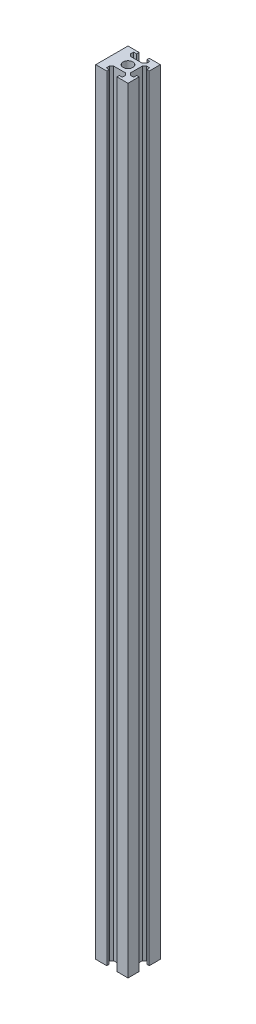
from build123d import *

# Parameters (mm, degrees)
SKIZZE1_R                       = 3
AUFSATZ_LINEAR_AUSTRAGEN1_DEPTH = 480


with BuildPart() as part:
    # Skizze1 → Aufsatz-Linear austragen1 (new body)
    with BuildSketch(Plane(origin=(0, 0, 0), x_dir=(1, 0, 0), z_dir=(0, 1, 0))):
        Polygon((-3.125, 10), (-3.125, 8.5), (-5, 8.5), (-5, 6.504827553), (-3.707168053, 5.2), (3.707168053, 5.2), (5, 6.504827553), (5, 8.5), (3.125, 8.5), (3.125, 10), (10, 10), (10, 3.125), (8.5, 3.125), (8.5, 5), (6.504827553, 5), (5.2, 3.707168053), (5.2, -3.707168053), (6.504827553, -5), (8.5, -5), (8.5, -3.125), (10, -3.125), (10, -10), (3.125, -10), (3.125, -8.5), (5, -8.5), (5, -6.504827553), (3.707168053, -5.2), (-3.707168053, -5.2), (-5, -6.504827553), (-5, -8.5), (-3.125, -8.5), (-3.125, -10), (-10, -10), (-10, 10), align=None)
        with Locations(Location((0, 0, 0), (0, 0, 270))):
            Circle(SKIZZE1_R, mode=Mode.SUBTRACT)
    extrude(amount=AUFSATZ_LINEAR_AUSTRAGEN1_DEPTH)


solid = part.part
